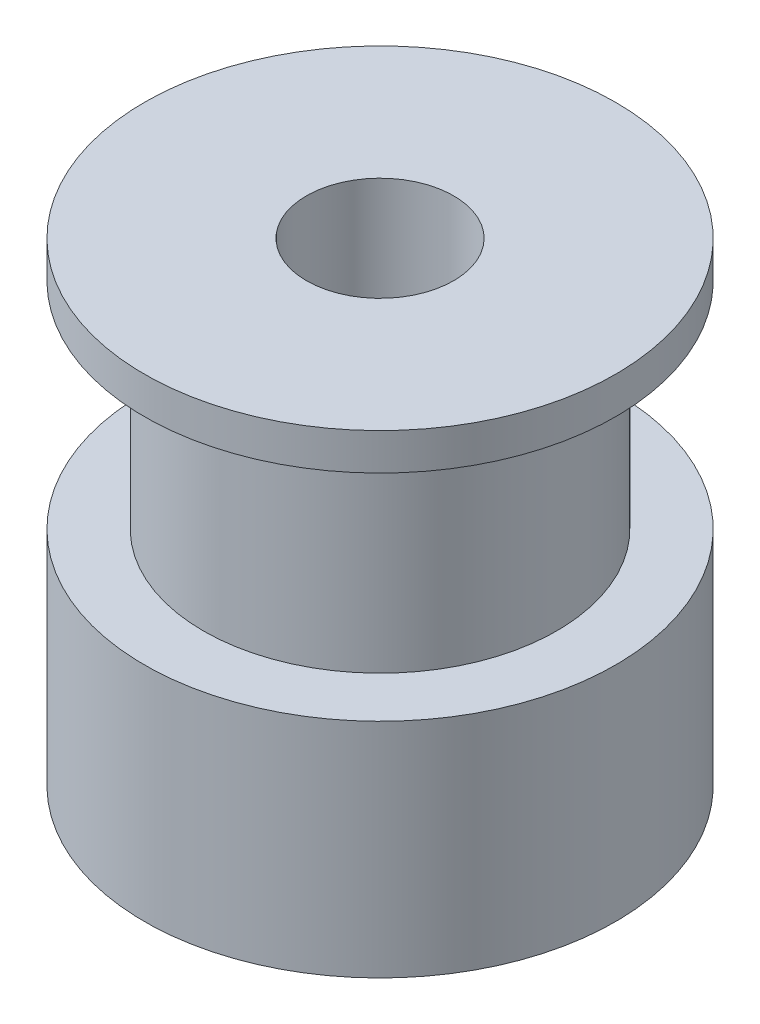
ISO-10303-21;
HEADER;
FILE_DESCRIPTION(('STEP AP214'),'2;1');
FILE_NAME('part.step','',(''),(''),'','','');
FILE_SCHEMA(('AUTOMOTIVE_DESIGN { 1 0 10303 214 1 1 1 1 }'));
ENDSEC;
DATA;
#1=APPLICATION_CONTEXT('core data for automotive mechanical design processes');
#2=APPLICATION_PROTOCOL_DEFINITION('international standard','automotive_design',2000,#1);
#3=PRODUCT_CONTEXT('',#1,'mechanical');
#4=PRODUCT('Part','Part','',(#3));
#5=PRODUCT_RELATED_PRODUCT_CATEGORY('part','',(#4));
#6=PRODUCT_DEFINITION_FORMATION('','',#4);
#7=PRODUCT_DEFINITION_CONTEXT('part definition',#1,'design');
#8=PRODUCT_DEFINITION('design','',#6,#7);
#9=PRODUCT_DEFINITION_SHAPE('','',#8);
#10=(LENGTH_UNIT() NAMED_UNIT(*) SI_UNIT(.MILLI.,.METRE.));
#11=(NAMED_UNIT(*) PLANE_ANGLE_UNIT() SI_UNIT($,.RADIAN.));
#12=(NAMED_UNIT(*) SI_UNIT($,.STERADIAN.) SOLID_ANGLE_UNIT());
#13=UNCERTAINTY_MEASURE_WITH_UNIT(LENGTH_MEASURE(1.E-05),#10,'distance_accuracy_value','');
#14=(GEOMETRIC_REPRESENTATION_CONTEXT(3) GLOBAL_UNCERTAINTY_ASSIGNED_CONTEXT((#13)) GLOBAL_UNIT_ASSIGNED_CONTEXT((#10,
#11,#12)) REPRESENTATION_CONTEXT('',''));
#15=CARTESIAN_POINT('',(0.,0.,0.));
#16=DIRECTION('',(0.,0.,1.));
#17=DIRECTION('',(1.,0.,0.));
#18=AXIS2_PLACEMENT_3D('',#15,#16,#17);
#19=CARTESIAN_POINT('',(0.,0.,0.));
#20=DIRECTION('',(0.,-1.,0.));
#21=DIRECTION('',(0.,0.,-1.));
#22=AXIS2_PLACEMENT_3D('',#19,#20,#21);
#23=PLANE('',#22);
#24=CARTESIAN_POINT('',(0.,0.,0.));
#25=DIRECTION('',(0.,1.,0.));
#26=DIRECTION('',(0.,0.,1.));
#27=AXIS2_PLACEMENT_3D('',#24,#25,#26);
#28=CIRCLE('',#27,2.5);
#29=CARTESIAN_POINT('',(0.,0.,2.5));
#30=VERTEX_POINT('',#29);
#31=EDGE_CURVE('E60',#30,#30,#28,.T.);
#32=ORIENTED_EDGE('',*,*,#31,.T.);
#33=EDGE_LOOP('',(#32));
#34=FACE_BOUND('',#33,.T.);
#35=CARTESIAN_POINT('',(0.,0.,0.));
#36=DIRECTION('',(0.,-1.,0.));
#37=DIRECTION('',(0.,0.,-1.));
#38=AXIS2_PLACEMENT_3D('',#35,#36,#37);
#39=CIRCLE('',#38,8.);
#40=CARTESIAN_POINT('',(0.,0.,-8.));
#41=VERTEX_POINT('',#40);
#42=EDGE_CURVE('E10',#41,#41,#39,.T.);
#43=ORIENTED_EDGE('',*,*,#42,.T.);
#44=EDGE_LOOP('',(#43));
#45=FACE_BOUND('',#44,.T.);
#46=ADVANCED_FACE('F35',(#34,#45),#23,.T.);
#47=CARTESIAN_POINT('',(0.,0.,0.));
#48=DIRECTION('',(0.,-1.,0.));
#49=DIRECTION('',(0.,0.,-1.));
#50=AXIS2_PLACEMENT_3D('',#47,#48,#49);
#51=CYLINDRICAL_SURFACE('',#50,8.);
#52=CARTESIAN_POINT('',(0.,7.55,0.));
#53=DIRECTION('',(0.,-1.,0.));
#54=DIRECTION('',(0.,0.,-1.));
#55=AXIS2_PLACEMENT_3D('',#52,#53,#54);
#56=CIRCLE('',#55,8.);
#57=CARTESIAN_POINT('',(0.,7.55,-8.));
#58=VERTEX_POINT('',#57);
#59=EDGE_CURVE('E41',#58,#58,#56,.T.);
#60=ORIENTED_EDGE('',*,*,#59,.T.);
#61=EDGE_LOOP('',(#60));
#62=FACE_BOUND('',#61,.T.);
#63=ORIENTED_EDGE('',*,*,#42,.F.);
#64=EDGE_LOOP('',(#63));
#65=FACE_BOUND('',#64,.T.);
#66=ADVANCED_FACE('F101',(#62,#65),#51,.T.);
#67=CARTESIAN_POINT('',(6.,7.55,0.));
#68=DIRECTION('',(0.,1.,0.));
#69=DIRECTION('',(0.,0.,1.));
#70=AXIS2_PLACEMENT_3D('',#67,#68,#69);
#71=PLANE('',#70);
#72=CARTESIAN_POINT('',(0.,7.55,0.));
#73=DIRECTION('',(0.,-1.,0.));
#74=DIRECTION('',(0.,0.,-1.));
#75=AXIS2_PLACEMENT_3D('',#72,#73,#74);
#76=CIRCLE('',#75,6.);
#77=CARTESIAN_POINT('',(0.,7.55,-6.));
#78=VERTEX_POINT('',#77);
#79=EDGE_CURVE('E45',#78,#78,#76,.T.);
#80=ORIENTED_EDGE('',*,*,#79,.T.);
#81=EDGE_LOOP('',(#80));
#82=FACE_BOUND('',#81,.T.);
#83=ORIENTED_EDGE('',*,*,#59,.F.);
#84=EDGE_LOOP('',(#83));
#85=FACE_BOUND('',#84,.T.);
#86=ADVANCED_FACE('F95',(#82,#85),#71,.T.);
#87=CARTESIAN_POINT('',(0.,0.,0.));
#88=DIRECTION('',(0.,-1.,0.));
#89=DIRECTION('',(0.,0.,-1.));
#90=AXIS2_PLACEMENT_3D('',#87,#88,#89);
#91=CYLINDRICAL_SURFACE('',#90,6.);
#92=CARTESIAN_POINT('',(0.,14.85,0.));
#93=DIRECTION('',(0.,-1.,0.));
#94=DIRECTION('',(0.,0.,-1.));
#95=AXIS2_PLACEMENT_3D('',#92,#93,#94);
#96=CIRCLE('',#95,6.);
#97=CARTESIAN_POINT('',(0.,14.85,-6.));
#98=VERTEX_POINT('',#97);
#99=EDGE_CURVE('E49',#98,#98,#96,.T.);
#100=ORIENTED_EDGE('',*,*,#99,.T.);
#101=EDGE_LOOP('',(#100));
#102=FACE_BOUND('',#101,.T.);
#103=ORIENTED_EDGE('',*,*,#79,.F.);
#104=EDGE_LOOP('',(#103));
#105=FACE_BOUND('',#104,.T.);
#106=ADVANCED_FACE('F89',(#102,#105),#91,.T.);
#107=CARTESIAN_POINT('',(8.,14.85,0.));
#108=DIRECTION('',(0.,-1.,0.));
#109=DIRECTION('',(0.,0.,-1.));
#110=AXIS2_PLACEMENT_3D('',#107,#108,#109);
#111=PLANE('',#110);
#112=CARTESIAN_POINT('',(0.,14.85,0.));
#113=DIRECTION('',(0.,-1.,0.));
#114=DIRECTION('',(0.,0.,-1.));
#115=AXIS2_PLACEMENT_3D('',#112,#113,#114);
#116=CIRCLE('',#115,8.);
#117=CARTESIAN_POINT('',(0.,14.85,-8.));
#118=VERTEX_POINT('',#117);
#119=EDGE_CURVE('E54',#118,#118,#116,.T.);
#120=ORIENTED_EDGE('',*,*,#119,.T.);
#121=EDGE_LOOP('',(#120));
#122=FACE_BOUND('',#121,.T.);
#123=ORIENTED_EDGE('',*,*,#99,.F.);
#124=EDGE_LOOP('',(#123));
#125=FACE_BOUND('',#124,.T.);
#126=ADVANCED_FACE('F83',(#122,#125),#111,.T.);
#127=CARTESIAN_POINT('',(0.,0.,0.));
#128=DIRECTION('',(0.,-1.,0.));
#129=DIRECTION('',(0.,0.,-1.));
#130=AXIS2_PLACEMENT_3D('',#127,#128,#129);
#131=CYLINDRICAL_SURFACE('',#130,8.);
#132=CARTESIAN_POINT('',(0.,16.1,0.));
#133=DIRECTION('',(0.,-1.,0.));
#134=DIRECTION('',(0.,0.,-1.));
#135=AXIS2_PLACEMENT_3D('',#132,#133,#134);
#136=CIRCLE('',#135,8.);
#137=CARTESIAN_POINT('',(0.,16.1,-8.));
#138=VERTEX_POINT('',#137);
#139=EDGE_CURVE('E57',#138,#138,#136,.T.);
#140=ORIENTED_EDGE('',*,*,#139,.T.);
#141=EDGE_LOOP('',(#140));
#142=FACE_BOUND('',#141,.T.);
#143=ORIENTED_EDGE('',*,*,#119,.F.);
#144=EDGE_LOOP('',(#143));
#145=FACE_BOUND('',#144,.T.);
#146=ADVANCED_FACE('F77',(#142,#145),#131,.T.);
#147=CARTESIAN_POINT('',(0.,16.1,0.));
#148=DIRECTION('',(0.,1.,0.));
#149=DIRECTION('',(0.,0.,1.));
#150=AXIS2_PLACEMENT_3D('',#147,#148,#149);
#151=PLANE('',#150);
#152=CARTESIAN_POINT('',(0.,16.1,0.));
#153=DIRECTION('',(0.,1.,0.));
#154=DIRECTION('',(0.,0.,1.));
#155=AXIS2_PLACEMENT_3D('',#152,#153,#154);
#156=CIRCLE('',#155,2.5);
#157=CARTESIAN_POINT('',(0.,16.1,2.5));
#158=VERTEX_POINT('',#157);
#159=EDGE_CURVE('E61',#158,#158,#156,.T.);
#160=ORIENTED_EDGE('',*,*,#159,.F.);
#161=EDGE_LOOP('',(#160));
#162=FACE_BOUND('',#161,.T.);
#163=ORIENTED_EDGE('',*,*,#139,.F.);
#164=EDGE_LOOP('',(#163));
#165=FACE_BOUND('',#164,.T.);
#166=ADVANCED_FACE('F71',(#162,#165),#151,.T.);
#167=CARTESIAN_POINT('',(0.,0.,0.));
#168=DIRECTION('',(0.,1.,0.));
#169=DIRECTION('',(0.,0.,1.));
#170=AXIS2_PLACEMENT_3D('',#167,#168,#169);
#171=CYLINDRICAL_SURFACE('',#170,2.5);
#172=ORIENTED_EDGE('',*,*,#31,.F.);
#173=EDGE_LOOP('',(#172));
#174=FACE_BOUND('',#173,.T.);
#175=ORIENTED_EDGE('',*,*,#159,.T.);
#176=EDGE_LOOP('',(#175));
#177=FACE_BOUND('',#176,.T.);
#178=ADVANCED_FACE('F68',(#174,#177),#171,.F.);
#179=CLOSED_SHELL('',(#46,#66,#86,#106,#126,#146,#166,#178));
#180=MANIFOLD_SOLID_BREP('B2',#179);
#181=ADVANCED_BREP_SHAPE_REPRESENTATION('',(#18,#180),#14);
#182=SHAPE_DEFINITION_REPRESENTATION(#9,#181);
ENDSEC;
END-ISO-10303-21;
